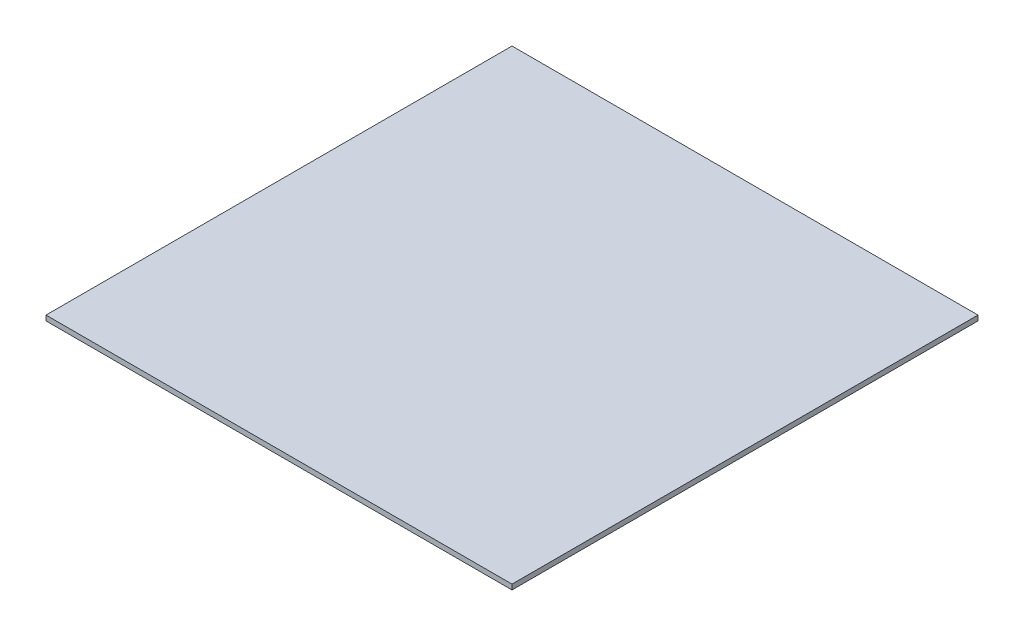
ISO-10303-21;
HEADER;
FILE_DESCRIPTION(('STEP AP214'),'2;1');
FILE_NAME('part.step','',(''),(''),'','','');
FILE_SCHEMA(('AUTOMOTIVE_DESIGN { 1 0 10303 214 1 1 1 1 }'));
ENDSEC;
DATA;
#1=APPLICATION_CONTEXT('core data for automotive mechanical design processes');
#2=APPLICATION_PROTOCOL_DEFINITION('international standard','automotive_design',2000,#1);
#3=PRODUCT_CONTEXT('',#1,'mechanical');
#4=PRODUCT('Part','Part','',(#3));
#5=PRODUCT_RELATED_PRODUCT_CATEGORY('part','',(#4));
#6=PRODUCT_DEFINITION_FORMATION('','',#4);
#7=PRODUCT_DEFINITION_CONTEXT('part definition',#1,'design');
#8=PRODUCT_DEFINITION('design','',#6,#7);
#9=PRODUCT_DEFINITION_SHAPE('','',#8);
#10=(LENGTH_UNIT() NAMED_UNIT(*) SI_UNIT(.MILLI.,.METRE.));
#11=(NAMED_UNIT(*) PLANE_ANGLE_UNIT() SI_UNIT($,.RADIAN.));
#12=(NAMED_UNIT(*) SI_UNIT($,.STERADIAN.) SOLID_ANGLE_UNIT());
#13=UNCERTAINTY_MEASURE_WITH_UNIT(LENGTH_MEASURE(1.E-05),#10,'distance_accuracy_value','');
#14=(GEOMETRIC_REPRESENTATION_CONTEXT(3) GLOBAL_UNCERTAINTY_ASSIGNED_CONTEXT((#13)) GLOBAL_UNIT_ASSIGNED_CONTEXT((#10,
#11,#12)) REPRESENTATION_CONTEXT('',''));
#15=CARTESIAN_POINT('',(0.,0.,0.));
#16=DIRECTION('',(0.,0.,1.));
#17=DIRECTION('',(1.,0.,0.));
#18=AXIS2_PLACEMENT_3D('',#15,#16,#17);
#19=CARTESIAN_POINT('',(-228.6,-5.,228.6));
#20=DIRECTION('',(-1.,0.,0.));
#21=DIRECTION('',(0.,0.,1.));
#22=AXIS2_PLACEMENT_3D('',#19,#20,#21);
#23=PLANE('',#22);
#24=DIRECTION('',(0.,0.,1.));
#25=VECTOR('',#24,1.);
#26=CARTESIAN_POINT('',(-228.6,0.,228.6));
#27=LINE('',#26,#25);
#28=CARTESIAN_POINT('',(-228.6,0.,-228.6));
#29=VERTEX_POINT('',#28);
#30=CARTESIAN_POINT('',(-228.6,0.,228.6));
#31=VERTEX_POINT('',#30);
#32=EDGE_CURVE('E100',#29,#31,#27,.T.);
#33=ORIENTED_EDGE('',*,*,#32,.F.);
#34=DIRECTION('',(0.,1.,0.));
#35=VECTOR('',#34,1.);
#36=CARTESIAN_POINT('',(-228.6,-5.,-228.6));
#37=LINE('',#36,#35);
#38=CARTESIAN_POINT('',(-228.6,-5.,-228.6));
#39=VERTEX_POINT('',#38);
#40=EDGE_CURVE('E11',#39,#29,#37,.T.);
#41=ORIENTED_EDGE('',*,*,#40,.F.);
#42=DIRECTION('',(0.,0.,1.));
#43=VECTOR('',#42,1.);
#44=CARTESIAN_POINT('',(-228.6,-5.,228.6));
#45=LINE('',#44,#43);
#46=CARTESIAN_POINT('',(-228.6,-5.,228.6));
#47=VERTEX_POINT('',#46);
#48=EDGE_CURVE('E94',#39,#47,#45,.T.);
#49=ORIENTED_EDGE('',*,*,#48,.T.);
#50=DIRECTION('',(0.,1.,0.));
#51=VECTOR('',#50,1.);
#52=CARTESIAN_POINT('',(-228.6,-5.,228.6));
#53=LINE('',#52,#51);
#54=EDGE_CURVE('E39',#47,#31,#53,.T.);
#55=ORIENTED_EDGE('',*,*,#54,.T.);
#56=EDGE_LOOP('',(#33,#41,#49,#55));
#57=FACE_BOUND('',#56,.T.);
#58=ADVANCED_FACE('F36',(#57),#23,.T.);
#59=CARTESIAN_POINT('',(-228.6,-5.,-228.6));
#60=DIRECTION('',(0.,0.,-1.));
#61=DIRECTION('',(-1.,0.,0.));
#62=AXIS2_PLACEMENT_3D('',#59,#60,#61);
#63=PLANE('',#62);
#64=DIRECTION('',(-1.,0.,0.));
#65=VECTOR('',#64,1.);
#66=CARTESIAN_POINT('',(-228.6,0.,-228.6));
#67=LINE('',#66,#65);
#68=CARTESIAN_POINT('',(228.6,0.,-228.6));
#69=VERTEX_POINT('',#68);
#70=EDGE_CURVE('E96',#69,#29,#67,.T.);
#71=ORIENTED_EDGE('',*,*,#70,.F.);
#72=DIRECTION('',(0.,1.,0.));
#73=VECTOR('',#72,1.);
#74=CARTESIAN_POINT('',(228.6,-5.,-228.6));
#75=LINE('',#74,#73);
#76=CARTESIAN_POINT('',(228.6,-5.,-228.6));
#77=VERTEX_POINT('',#76);
#78=EDGE_CURVE('E45',#77,#69,#75,.T.);
#79=ORIENTED_EDGE('',*,*,#78,.F.);
#80=DIRECTION('',(-1.,0.,0.));
#81=VECTOR('',#80,1.);
#82=CARTESIAN_POINT('',(-228.6,-5.,-228.6));
#83=LINE('',#82,#81);
#84=EDGE_CURVE('E91',#77,#39,#83,.T.);
#85=ORIENTED_EDGE('',*,*,#84,.T.);
#86=ORIENTED_EDGE('',*,*,#40,.T.);
#87=EDGE_LOOP('',(#71,#79,#85,#86));
#88=FACE_BOUND('',#87,.T.);
#89=ADVANCED_FACE('F110',(#88),#63,.T.);
#90=CARTESIAN_POINT('',(228.6,-5.,228.6));
#91=DIRECTION('',(1.,0.,0.));
#92=DIRECTION('',(0.,0.,-1.));
#93=AXIS2_PLACEMENT_3D('',#90,#91,#92);
#94=PLANE('',#93);
#95=DIRECTION('',(0.,0.,-1.));
#96=VECTOR('',#95,1.);
#97=CARTESIAN_POINT('',(228.6,0.,228.6));
#98=LINE('',#97,#96);
#99=CARTESIAN_POINT('',(228.6,0.,228.6));
#100=VERTEX_POINT('',#99);
#101=EDGE_CURVE('E86',#100,#69,#98,.T.);
#102=ORIENTED_EDGE('',*,*,#101,.F.);
#103=DIRECTION('',(0.,1.,0.));
#104=VECTOR('',#103,1.);
#105=CARTESIAN_POINT('',(228.6,-5.,228.6));
#106=LINE('',#105,#104);
#107=CARTESIAN_POINT('',(228.6,-5.,228.6));
#108=VERTEX_POINT('',#107);
#109=EDGE_CURVE('E81',#108,#100,#106,.T.);
#110=ORIENTED_EDGE('',*,*,#109,.F.);
#111=DIRECTION('',(0.,0.,-1.));
#112=VECTOR('',#111,1.);
#113=CARTESIAN_POINT('',(228.6,-5.,228.6));
#114=LINE('',#113,#112);
#115=EDGE_CURVE('E84',#108,#77,#114,.T.);
#116=ORIENTED_EDGE('',*,*,#115,.T.);
#117=ORIENTED_EDGE('',*,*,#78,.T.);
#118=EDGE_LOOP('',(#102,#110,#116,#117));
#119=FACE_BOUND('',#118,.T.);
#120=ADVANCED_FACE('F83',(#119),#94,.T.);
#121=CARTESIAN_POINT('',(-228.6,-5.,228.6));
#122=DIRECTION('',(0.,0.,1.));
#123=DIRECTION('',(1.,0.,0.));
#124=AXIS2_PLACEMENT_3D('',#121,#122,#123);
#125=PLANE('',#124);
#126=DIRECTION('',(1.,0.,0.));
#127=VECTOR('',#126,1.);
#128=CARTESIAN_POINT('',(-228.6,0.,228.6));
#129=LINE('',#128,#127);
#130=EDGE_CURVE('E103',#31,#100,#129,.T.);
#131=ORIENTED_EDGE('',*,*,#130,.F.);
#132=ORIENTED_EDGE('',*,*,#54,.F.);
#133=DIRECTION('',(1.,0.,0.));
#134=VECTOR('',#133,1.);
#135=CARTESIAN_POINT('',(-228.6,-5.,228.6));
#136=LINE('',#135,#134);
#137=EDGE_CURVE('E90',#47,#108,#136,.T.);
#138=ORIENTED_EDGE('',*,*,#137,.T.);
#139=ORIENTED_EDGE('',*,*,#109,.T.);
#140=EDGE_LOOP('',(#131,#132,#138,#139));
#141=FACE_BOUND('',#140,.T.);
#142=ADVANCED_FACE('F93',(#141),#125,.T.);
#143=CARTESIAN_POINT('',(-228.6,-5.,-228.6));
#144=DIRECTION('',(0.,-1.,0.));
#145=DIRECTION('',(0.,0.,-1.));
#146=AXIS2_PLACEMENT_3D('',#143,#144,#145);
#147=PLANE('',#146);
#148=ORIENTED_EDGE('',*,*,#48,.F.);
#149=ORIENTED_EDGE('',*,*,#84,.F.);
#150=ORIENTED_EDGE('',*,*,#115,.F.);
#151=ORIENTED_EDGE('',*,*,#137,.F.);
#152=EDGE_LOOP('',(#148,#149,#150,#151));
#153=FACE_BOUND('',#152,.T.);
#154=ADVANCED_FACE('F89',(#153),#147,.T.);
#155=CARTESIAN_POINT('',(-228.6,0.,-228.6));
#156=DIRECTION('',(0.,-1.,0.));
#157=DIRECTION('',(0.,0.,-1.));
#158=AXIS2_PLACEMENT_3D('',#155,#156,#157);
#159=PLANE('',#158);
#160=ORIENTED_EDGE('',*,*,#32,.T.);
#161=ORIENTED_EDGE('',*,*,#130,.T.);
#162=ORIENTED_EDGE('',*,*,#101,.T.);
#163=ORIENTED_EDGE('',*,*,#70,.T.);
#164=EDGE_LOOP('',(#160,#161,#162,#163));
#165=FACE_BOUND('',#164,.T.);
#166=ADVANCED_FACE('F109',(#165),#159,.F.);
#167=CLOSED_SHELL('',(#58,#89,#120,#142,#154,#166));
#168=MANIFOLD_SOLID_BREP('B2',#167);
#169=ADVANCED_BREP_SHAPE_REPRESENTATION('',(#18,#168),#14);
#170=SHAPE_DEFINITION_REPRESENTATION(#9,#169);
ENDSEC;
END-ISO-10303-21;
